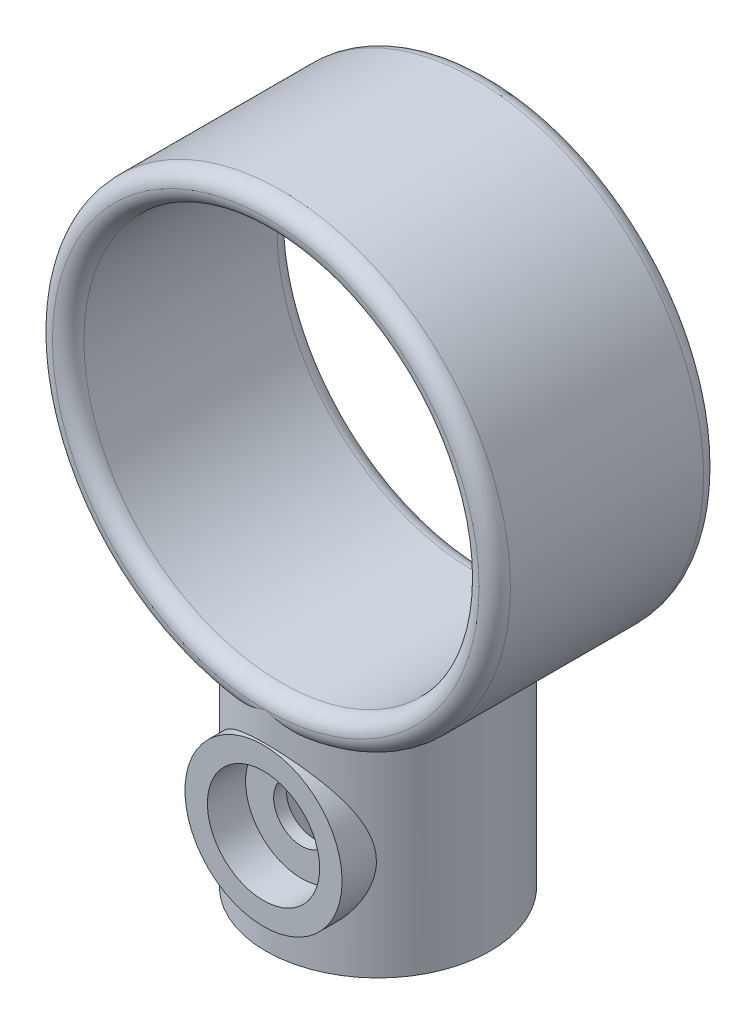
ISO-10303-21;
HEADER;
FILE_DESCRIPTION(('STEP AP214'),'2;1');
FILE_NAME('part.step','',(''),(''),'','','');
FILE_SCHEMA(('AUTOMOTIVE_DESIGN { 1 0 10303 214 1 1 1 1 }'));
ENDSEC;
DATA;
#1=APPLICATION_CONTEXT('core data for automotive mechanical design processes');
#2=APPLICATION_PROTOCOL_DEFINITION('international standard','automotive_design',2000,#1);
#3=PRODUCT_CONTEXT('',#1,'mechanical');
#4=PRODUCT('Part','Part','',(#3));
#5=PRODUCT_RELATED_PRODUCT_CATEGORY('part','',(#4));
#6=PRODUCT_DEFINITION_FORMATION('','',#4);
#7=PRODUCT_DEFINITION_CONTEXT('part definition',#1,'design');
#8=PRODUCT_DEFINITION('design','',#6,#7);
#9=PRODUCT_DEFINITION_SHAPE('','',#8);
#10=(LENGTH_UNIT() NAMED_UNIT(*) SI_UNIT(.MILLI.,.METRE.));
#11=(NAMED_UNIT(*) PLANE_ANGLE_UNIT() SI_UNIT($,.RADIAN.));
#12=(NAMED_UNIT(*) SI_UNIT($,.STERADIAN.) SOLID_ANGLE_UNIT());
#13=UNCERTAINTY_MEASURE_WITH_UNIT(LENGTH_MEASURE(1.E-05),#10,'distance_accuracy_value','');
#14=(GEOMETRIC_REPRESENTATION_CONTEXT(3) GLOBAL_UNCERTAINTY_ASSIGNED_CONTEXT((#13)) GLOBAL_UNIT_ASSIGNED_CONTEXT((#10,
#11,#12)) REPRESENTATION_CONTEXT('',''));
#15=CARTESIAN_POINT('',(0.,0.,0.));
#16=DIRECTION('',(0.,0.,1.));
#17=DIRECTION('',(1.,0.,0.));
#18=AXIS2_PLACEMENT_3D('',#15,#16,#17);
#19=CARTESIAN_POINT('',(-1.58750000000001,-13.081,3.60275071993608));
#20=DIRECTION('',(0.,0.,-1.));
#21=DIRECTION('',(-1.,0.,0.));
#22=AXIS2_PLACEMENT_3D('',#19,#20,#21);
#23=PLANE('',#22);
#24=CARTESIAN_POINT('',(0.,-18.161,3.60275071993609));
#25=DIRECTION('',(0.,0.,-1.));
#26=DIRECTION('',(-1.,0.,0.));
#27=AXIS2_PLACEMENT_3D('',#24,#25,#26);
#28=CIRCLE('',#27,1.5875);
#29=CARTESIAN_POINT('',(1.58750000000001,-18.161,3.60275071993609));
#30=VERTEX_POINT('',#29);
#31=CARTESIAN_POINT('',(-1.58750000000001,-18.161,3.60275071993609));
#32=VERTEX_POINT('',#31);
#33=EDGE_CURVE('E49',#30,#32,#28,.F.);
#34=ORIENTED_EDGE('',*,*,#33,.T.);
#35=DIRECTION('',(0.,-1.,0.));
#36=VECTOR('',#35,1.);
#37=CARTESIAN_POINT('',(-1.58750000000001,-13.081,3.60275071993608));
#38=LINE('',#37,#36);
#39=CARTESIAN_POINT('',(-1.58750000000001,-13.081,3.60275071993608));
#40=VERTEX_POINT('',#39);
#41=EDGE_CURVE('E95',#40,#32,#38,.T.);
#42=ORIENTED_EDGE('',*,*,#41,.F.);
#43=DIRECTION('',(1.,0.,0.));
#44=VECTOR('',#43,1.);
#45=CARTESIAN_POINT('',(-1.58750000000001,-13.081,3.60275071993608));
#46=LINE('',#45,#44);
#47=CARTESIAN_POINT('',(1.58750000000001,-13.081,3.60275071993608));
#48=VERTEX_POINT('',#47);
#49=EDGE_CURVE('E301',#40,#48,#46,.T.);
#50=ORIENTED_EDGE('',*,*,#49,.T.);
#51=DIRECTION('',(0.,-1.,0.));
#52=VECTOR('',#51,1.);
#53=CARTESIAN_POINT('',(1.58750000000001,-13.081,3.60275071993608));
#54=LINE('',#53,#52);
#55=EDGE_CURVE('E98',#48,#30,#54,.T.);
#56=ORIENTED_EDGE('',*,*,#55,.T.);
#57=EDGE_LOOP('',(#34,#42,#50,#56));
#58=FACE_BOUND('',#57,.T.);
#59=ADVANCED_FACE('F33',(#58),#23,.T.);
#60=CARTESIAN_POINT('',(0.,0.,6.35));
#61=DIRECTION('',(0.,0.,-1.));
#62=DIRECTION('',(-1.,0.,0.));
#63=AXIS2_PLACEMENT_3D('',#60,#61,#62);
#64=CYLINDRICAL_SURFACE('',#63,12.954);
#65=CARTESIAN_POINT('',(3.24036710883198,-12.5421743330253,5.46099999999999));
#66=CARTESIAN_POINT('',(3.39852522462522,-12.5013289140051,5.3671597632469));
#67=CARTESIAN_POINT('',(3.55217752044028,-12.4584249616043,5.26669390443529));
#68=CARTESIAN_POINT('',(3.8496509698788,-12.3697324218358,5.05333201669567));
#69=CARTESIAN_POINT('',(3.99347466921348,-12.3239445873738,4.94043922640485));
#70=CARTESIAN_POINT('',(4.27083010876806,-12.2306014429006,4.70275872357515));
#71=CARTESIAN_POINT('',(4.40434080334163,-12.1830427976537,4.57794779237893));
#72=CARTESIAN_POINT('',(4.66006458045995,-12.0875364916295,4.31736305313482));
#73=CARTESIAN_POINT('',(4.78227686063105,-12.0395888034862,4.18158846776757));
#74=CARTESIAN_POINT('',(5.0146904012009,-11.944653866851,3.89983668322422));
#75=CARTESIAN_POINT('',(5.12489323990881,-11.8976664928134,3.75386082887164));
#76=CARTESIAN_POINT('',(5.33259764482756,-11.8060325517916,3.45244782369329));
#77=CARTESIAN_POINT('',(5.43009998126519,-11.7613858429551,3.29701124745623));
#78=CARTESIAN_POINT('',(5.61163527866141,-11.6758611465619,2.97754710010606));
#79=CARTESIAN_POINT('',(5.69567354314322,-11.634981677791,2.8135229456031));
#80=CARTESIAN_POINT('',(5.84950609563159,-11.5584072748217,2.47786884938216));
#81=CARTESIAN_POINT('',(5.91930894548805,-11.5227092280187,2.30624355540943));
#82=CARTESIAN_POINT('',(6.04225375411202,-11.4587068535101,1.96119636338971));
#83=CARTESIAN_POINT('',(6.09579731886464,-11.4302277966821,1.78795037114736));
#84=CARTESIAN_POINT('',(6.18802378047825,-11.3805635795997,1.43660218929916));
#85=CARTESIAN_POINT('',(6.22671417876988,-11.3593747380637,1.2585024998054));
#86=CARTESIAN_POINT('',(6.28868651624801,-11.3251840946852,0.898983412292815));
#87=CARTESIAN_POINT('',(6.31197893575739,-11.3121767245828,0.717566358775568));
#88=CARTESIAN_POINT('',(6.3428187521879,-11.2949141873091,0.352992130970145));
#89=CARTESIAN_POINT('',(6.3503680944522,-11.2906579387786,0.169835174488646));
#90=CARTESIAN_POINT('',(6.34965030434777,-11.2910603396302,-0.174261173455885));
#91=CARTESIAN_POINT('',(6.34318530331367,-11.2947032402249,-0.335209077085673));
#92=CARTESIAN_POINT('',(6.31808188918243,-11.3087650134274,-0.655908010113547));
#93=CARTESIAN_POINT('',(6.29943960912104,-11.3191860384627,-0.815658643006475));
#94=CARTESIAN_POINT('',(6.25021818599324,-11.3464388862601,-1.1326968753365));
#95=CARTESIAN_POINT('',(6.21964262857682,-11.3632687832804,-1.28998519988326));
#96=CARTESIAN_POINT('',(6.14689582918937,-11.4027846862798,-1.60116103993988));
#97=CARTESIAN_POINT('',(6.10472002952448,-11.4254729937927,-1.75504719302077));
#98=CARTESIAN_POINT('',(6.00975901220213,-11.4757030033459,-2.05669794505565));
#99=CARTESIAN_POINT('',(5.95710152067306,-11.5031858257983,-2.20451262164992));
#100=CARTESIAN_POINT('',(5.84134309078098,-11.5623982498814,-2.49513680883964));
#101=CARTESIAN_POINT('',(5.77823846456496,-11.5941293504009,-2.63794453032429));
#102=CARTESIAN_POINT('',(5.57389486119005,-11.694479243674,-3.05794933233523));
#103=CARTESIAN_POINT('',(5.41761476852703,-11.7682609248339,-3.32676388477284));
#104=CARTESIAN_POINT('',(5.04847190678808,-11.9316543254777,-3.86714840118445));
#105=CARTESIAN_POINT('',(4.83113561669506,-12.0221086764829,-4.1353828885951));
#106=CARTESIAN_POINT('',(4.35599693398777,-12.2022811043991,-4.63311734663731));
#107=CARTESIAN_POINT('',(4.09825242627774,-12.2920000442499,-4.86267176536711));
#108=CARTESIAN_POINT('',(3.72972717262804,-12.405838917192,-5.14055569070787));
#109=CARTESIAN_POINT('',(3.6344671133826,-12.4341060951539,-5.20834633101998));
#110=CARTESIAN_POINT('',(3.44020812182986,-12.4892450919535,-5.33864235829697));
#111=CARTESIAN_POINT('',(3.34121442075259,-12.5161187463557,-5.40115476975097));
#112=CARTESIAN_POINT('',(3.24036710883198,-12.5421743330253,-5.46100000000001));
#113=B_SPLINE_CURVE_WITH_KNOTS('',3,(#65,#66,#67,#68,#69,#70,#71,#72,#73,#74,#75,#76,#77,#78,
#79,#80,#81,#82,#83,#84,#85,#86,#87,#88,#89,#90,#91,#92,#93,#94,#95,#96,#97,#98,#99,#100,#101,
#102,#103,#104,#105,#106,#107,#108,#109,#110,#111,#112),.UNSPECIFIED.,.F.,.F.,(4,2,2,2,2,2,2,2,
2,2,2,2,2,2,2,2,2,2,2,2,2,2,2,4),(0.,0.56491857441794,1.1296902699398,1.69558560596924,
2.26152109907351,2.82738212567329,3.3932088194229,3.95881208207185,4.52407415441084,
5.07395790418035,5.62356357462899,6.17279478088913,6.72195811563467,7.20471712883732,
7.68762951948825,8.17039691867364,8.65335426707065,9.13075176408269,9.6083181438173,
10.5633377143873,11.6297455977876,12.6946395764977,13.0553653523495,13.4156032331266),.UNSPECIFIED.);
#114=CARTESIAN_POINT('',(3.24036710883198,-12.5421743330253,5.46099999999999));
#115=VERTEX_POINT('',#114);
#116=CARTESIAN_POINT('',(3.24036710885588,-12.5421743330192,-5.46100000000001));
#117=VERTEX_POINT('',#116);
#118=EDGE_CURVE('E186',#115,#117,#113,.T.);
#119=ORIENTED_EDGE('',*,*,#118,.T.);
#120=CARTESIAN_POINT('',(0.,0.,-5.461));
#121=DIRECTION('',(0.,0.,1.));
#122=DIRECTION('',(1.,0.,0.));
#123=AXIS2_PLACEMENT_3D('',#120,#121,#122);
#124=CIRCLE('',#123,12.954);
#125=CARTESIAN_POINT('',(-3.24036710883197,-12.5421743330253,-5.461));
#126=VERTEX_POINT('',#125);
#127=EDGE_CURVE('E206',#117,#126,#124,.T.);
#128=ORIENTED_EDGE('',*,*,#127,.T.);
#129=CARTESIAN_POINT('',(-3.24036710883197,-12.5421743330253,-5.461));
#130=CARTESIAN_POINT('',(-3.39852522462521,-12.5013289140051,-5.3671597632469));
#131=CARTESIAN_POINT('',(-3.55217752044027,-12.4584249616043,-5.26669390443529));
#132=CARTESIAN_POINT('',(-3.84965096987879,-12.3697324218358,-5.05333201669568));
#133=CARTESIAN_POINT('',(-3.99347466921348,-12.3239445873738,-4.94043922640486));
#134=CARTESIAN_POINT('',(-4.27083010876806,-12.2306014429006,-4.70275872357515));
#135=CARTESIAN_POINT('',(-4.40434080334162,-12.1830427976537,-4.57794779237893));
#136=CARTESIAN_POINT('',(-4.66006458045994,-12.0875364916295,-4.31736305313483));
#137=CARTESIAN_POINT('',(-4.78227686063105,-12.0395888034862,-4.18158846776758));
#138=CARTESIAN_POINT('',(-5.0146904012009,-11.944653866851,-3.89983668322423));
#139=CARTESIAN_POINT('',(-5.12489323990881,-11.8976664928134,-3.75386082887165));
#140=CARTESIAN_POINT('',(-5.33259764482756,-11.8060325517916,-3.4524478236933));
#141=CARTESIAN_POINT('',(-5.43009998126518,-11.7613858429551,-3.29701124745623));
#142=CARTESIAN_POINT('',(-5.61163527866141,-11.6758611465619,-2.97754710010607));
#143=CARTESIAN_POINT('',(-5.69567354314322,-11.634981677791,-2.81352294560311));
#144=CARTESIAN_POINT('',(-5.84950609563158,-11.5584072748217,-2.47786884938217));
#145=CARTESIAN_POINT('',(-5.91930894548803,-11.5227092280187,-2.30624355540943));
#146=CARTESIAN_POINT('',(-6.042253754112,-11.4587068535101,-1.96119636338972));
#147=CARTESIAN_POINT('',(-6.09579731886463,-11.4302277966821,-1.78795037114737));
#148=CARTESIAN_POINT('',(-6.18802378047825,-11.3805635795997,-1.43660218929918));
#149=CARTESIAN_POINT('',(-6.22671417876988,-11.3593747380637,-1.25850249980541));
#150=CARTESIAN_POINT('',(-6.28868651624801,-11.3251840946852,-0.898983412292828));
#151=CARTESIAN_POINT('',(-6.31197893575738,-11.3121767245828,-0.717566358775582));
#152=CARTESIAN_POINT('',(-6.3428187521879,-11.2949141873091,-0.35299213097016));
#153=CARTESIAN_POINT('',(-6.3503680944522,-11.2906579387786,-0.16983517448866));
#154=CARTESIAN_POINT('',(-6.34965030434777,-11.2910603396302,0.174261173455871));
#155=CARTESIAN_POINT('',(-6.34318530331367,-11.2947032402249,0.33520907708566));
#156=CARTESIAN_POINT('',(-6.31808188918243,-11.3087650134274,0.655908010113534));
#157=CARTESIAN_POINT('',(-6.29943960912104,-11.3191860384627,0.815658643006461));
#158=CARTESIAN_POINT('',(-6.25021818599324,-11.3464388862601,1.13269687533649));
#159=CARTESIAN_POINT('',(-6.21964262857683,-11.3632687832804,1.28998519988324));
#160=CARTESIAN_POINT('',(-6.14689582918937,-11.4027846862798,1.60116103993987));
#161=CARTESIAN_POINT('',(-6.10472002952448,-11.4254729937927,1.75504719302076));
#162=CARTESIAN_POINT('',(-6.00975901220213,-11.4757030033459,2.05669794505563));
#163=CARTESIAN_POINT('',(-5.95710152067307,-11.5031858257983,2.20451262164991));
#164=CARTESIAN_POINT('',(-5.84134309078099,-11.5623982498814,2.49513680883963));
#165=CARTESIAN_POINT('',(-5.77823846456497,-11.5941293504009,2.63794453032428));
#166=CARTESIAN_POINT('',(-5.57389486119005,-11.694479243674,3.05794933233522));
#167=CARTESIAN_POINT('',(-5.41761476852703,-11.7682609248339,3.32676388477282));
#168=CARTESIAN_POINT('',(-5.04847190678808,-11.9316543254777,3.86714840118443));
#169=CARTESIAN_POINT('',(-4.83113561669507,-12.0221086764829,4.13538288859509));
#170=CARTESIAN_POINT('',(-4.35599693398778,-12.2022811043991,4.63311734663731));
#171=CARTESIAN_POINT('',(-4.09825242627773,-12.2920000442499,4.8626717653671));
#172=CARTESIAN_POINT('',(-3.72972717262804,-12.405838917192,5.14055569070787));
#173=CARTESIAN_POINT('',(-3.6344671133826,-12.4341060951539,5.20834633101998));
#174=CARTESIAN_POINT('',(-3.44020812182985,-12.4892450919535,5.33864235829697));
#175=CARTESIAN_POINT('',(-3.34121442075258,-12.5161187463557,5.40115476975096));
#176=CARTESIAN_POINT('',(-3.24036710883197,-12.5421743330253,5.46099999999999));
#177=B_SPLINE_CURVE_WITH_KNOTS('',3,(#129,#130,#131,#132,#133,#134,#135,#136,#137,#138,#139,
#140,#141,#142,#143,#144,#145,#146,#147,#148,#149,#150,#151,#152,#153,#154,#155,#156,#157,#158,
#159,#160,#161,#162,#163,#164,#165,#166,#167,#168,#169,#170,#171,#172,#173,#174,#175,#176),
.UNSPECIFIED.,.F.,.F.,(4,2,2,2,2,2,2,2,2,2,2,2,2,2,2,2,2,2,2,2,2,2,2,4),(0.,0.564918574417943,
1.12969026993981,1.69558560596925,2.26152109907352,2.8273821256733,3.39320881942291,
3.95881208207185,4.52407415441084,5.07395790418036,5.62356357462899,6.17279478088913,
6.72195811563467,7.20471712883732,7.68762951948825,8.17039691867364,8.65335426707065,
9.1307517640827,9.6083181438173,10.5633377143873,11.6297455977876,12.6946395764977,
13.0553653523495,13.4156032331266),.UNSPECIFIED.);
#178=CARTESIAN_POINT('',(-3.24036710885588,-12.5421743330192,5.46099999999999));
#179=VERTEX_POINT('',#178);
#180=EDGE_CURVE('E181',#126,#179,#177,.T.);
#181=ORIENTED_EDGE('',*,*,#180,.T.);
#182=CARTESIAN_POINT('',(0.,0.,5.461));
#183=DIRECTION('',(0.,0.,1.));
#184=DIRECTION('',(1.,0.,0.));
#185=AXIS2_PLACEMENT_3D('',#182,#183,#184);
#186=CIRCLE('',#185,12.954);
#187=EDGE_CURVE('E208',#179,#115,#186,.F.);
#188=ORIENTED_EDGE('',*,*,#187,.T.);
#189=EDGE_LOOP('',(#119,#128,#181,#188));
#190=FACE_BOUND('',#189,.T.);
#191=ADVANCED_FACE('F141',(#190),#64,.T.);
#192=CARTESIAN_POINT('',(0.,0.,5.461));
#193=DIRECTION('',(0.,0.,1.));
#194=DIRECTION('',(1.,0.,0.));
#195=AXIS2_PLACEMENT_3D('',#192,#193,#194);
#196=TOROIDAL_SURFACE('',#195,12.065,0.889);
#197=ORIENTED_EDGE('',*,*,#187,.F.);
#198=CARTESIAN_POINT('',(0.,-12.065,6.34999999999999));
#199=CARTESIAN_POINT('',(-0.00497535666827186,-12.0668615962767,6.35000001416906));
#200=CARTESIAN_POINT('',(-0.00995194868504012,-12.0687205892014,6.34999416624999));
#201=CARTESIAN_POINT('',(-0.29672836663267,-12.1756671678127,6.34931912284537));
#202=CARTESIAN_POINT('',(-0.582434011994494,-12.2723149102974,6.32984568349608));
#203=CARTESIAN_POINT('',(-1.01283058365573,-12.3963076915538,6.27038770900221));
#204=CARTESIAN_POINT('',(-1.15680061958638,-12.4341795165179,6.24547220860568));
#205=CARTESIAN_POINT('',(-1.44453512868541,-12.501251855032,6.185257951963));
#206=CARTESIAN_POINT('',(-1.58829967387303,-12.5304577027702,6.14996560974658));
#207=CARTESIAN_POINT('',(-1.92510179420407,-12.5867279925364,6.05448732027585));
#208=CARTESIAN_POINT('',(-2.11771865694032,-12.6094410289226,5.98991176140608));
#209=CARTESIAN_POINT('',(-2.40170474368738,-12.6245893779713,5.8791706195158));
#210=CARTESIAN_POINT('',(-2.49539153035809,-12.6264977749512,5.84002066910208));
#211=CARTESIAN_POINT('',(-2.68065923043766,-12.6231756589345,5.75732810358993));
#212=CARTESIAN_POINT('',(-2.77224144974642,-12.6179497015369,5.71378830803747));
#213=CARTESIAN_POINT('',(-2.92708562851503,-12.6020217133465,5.63559423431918));
#214=CARTESIAN_POINT('',(-2.99103977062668,-12.5932835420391,5.60190418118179));
#215=CARTESIAN_POINT('',(-3.11725228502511,-12.5712265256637,5.5326711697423));
#216=CARTESIAN_POINT('',(-3.17950796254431,-12.5579008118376,5.49712550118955));
#217=CARTESIAN_POINT('',(-3.24070414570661,-12.5420872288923,5.46079999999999));
#218=B_SPLINE_CURVE_WITH_KNOTS('',3,(#198,#199,#200,#201,#202,#203,#204,#205,#206,#207,#208,
#209,#210,#211,#212,#213,#214,#215,#216,#217),.UNSPECIFIED.,.F.,.F.,(4,2,2,2,2,2,2,2,2,4),(0.,
0.015937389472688,0.918168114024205,1.37052248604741,1.82259783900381,2.43338323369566,
2.73776310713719,3.04194871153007,3.2602089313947,3.47879737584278),.UNSPECIFIED.);
#219=CARTESIAN_POINT('',(0.,-12.065,6.34999999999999));
#220=VERTEX_POINT('',#219);
#221=EDGE_CURVE('E112',#220,#179,#218,.T.);
#222=ORIENTED_EDGE('',*,*,#221,.F.);
#223=CARTESIAN_POINT('',(0.,0.,6.35));
#224=DIRECTION('',(0.,0.,1.));
#225=DIRECTION('',(1.,0.,0.));
#226=AXIS2_PLACEMENT_3D('',#223,#224,#225);
#227=CIRCLE('',#226,12.065);
#228=EDGE_CURVE('E209',#220,#220,#227,.F.);
#229=ORIENTED_EDGE('',*,*,#228,.T.);
#230=CARTESIAN_POINT('',(3.24070414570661,-12.5420872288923,5.46079999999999));
#231=CARTESIAN_POINT('',(3.1774310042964,-12.5584361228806,5.49835688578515));
#232=CARTESIAN_POINT('',(3.11303726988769,-12.5721249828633,5.53507566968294));
#233=CARTESIAN_POINT('',(2.98241388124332,-12.5946122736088,5.60653441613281));
#234=CARTESIAN_POINT('',(2.91618629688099,-12.6034159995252,5.64127648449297));
#235=CARTESIAN_POINT('',(2.71584054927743,-12.6231183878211,5.74185754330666));
#236=CARTESIAN_POINT('',(2.57940037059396,-12.6274673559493,5.80444370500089));
#237=CARTESIAN_POINT('',(2.32981479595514,-12.6222217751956,5.90838835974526));
#238=CARTESIAN_POINT('',(2.21731158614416,-12.6151794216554,5.95150677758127));
#239=CARTESIAN_POINT('',(1.99072682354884,-12.5930454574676,6.03108112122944));
#240=CARTESIAN_POINT('',(1.87664458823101,-12.5779502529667,6.06753406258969));
#241=CARTESIAN_POINT('',(1.53260221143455,-12.5222786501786,6.16689493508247));
#242=CARTESIAN_POINT('',(1.30126722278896,-12.4713340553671,6.21963097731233));
#243=CARTESIAN_POINT('',(0.945543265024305,-12.3775482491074,6.28049610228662));
#244=CARTESIAN_POINT('',(0.820672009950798,-12.3416721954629,6.29799398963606));
#245=CARTESIAN_POINT('',(0.571772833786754,-12.2651057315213,6.32544046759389));
#246=CARTESIAN_POINT('',(0.447743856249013,-12.2244234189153,6.33540155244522));
#247=CARTESIAN_POINT('',(0.220741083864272,-12.146010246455,6.34700860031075));
#248=CARTESIAN_POINT('',(0.11761462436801,-12.1088706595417,6.34974105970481));
#249=CARTESIAN_POINT('',(0.00995213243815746,-12.068720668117,6.34999415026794));
#250=CARTESIAN_POINT('',(0.00497554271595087,-12.0668616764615,6.34999999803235));
#251=CARTESIAN_POINT('',(0.,-12.065,6.34999999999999));
#252=B_SPLINE_CURVE_WITH_KNOTS('',3,(#230,#231,#232,#233,#234,#235,#236,#237,#238,#239,#240,
#241,#242,#243,#244,#245,#246,#247,#248,#249,#250,#251),.UNSPECIFIED.,.F.,.F.,(4,2,2,2,2,2,2,2,
2,2,4),(0.,0.225974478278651,0.451703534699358,0.900832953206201,1.26243424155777,
1.62419704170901,2.34907332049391,2.74214119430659,3.1345560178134,3.4633328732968,
3.47927026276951),.UNSPECIFIED.);
#253=EDGE_CURVE('E111',#115,#220,#252,.T.);
#254=ORIENTED_EDGE('',*,*,#253,.F.);
#255=EDGE_LOOP('',(#197,#222,#229,#254));
#256=FACE_BOUND('',#255,.T.);
#257=ADVANCED_FACE('F144',(#256),#196,.T.);
#258=CARTESIAN_POINT('',(0.,0.,-5.461));
#259=DIRECTION('',(0.,0.,1.));
#260=DIRECTION('',(1.,0.,0.));
#261=AXIS2_PLACEMENT_3D('',#258,#259,#260);
#262=TOROIDAL_SURFACE('',#261,12.065,0.889);
#263=ORIENTED_EDGE('',*,*,#127,.F.);
#264=CARTESIAN_POINT('',(0.,-12.065,-6.35));
#265=CARTESIAN_POINT('',(0.00497535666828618,-12.0668615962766,-6.35000001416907));
#266=CARTESIAN_POINT('',(0.00995194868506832,-12.0687205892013,-6.34999416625));
#267=CARTESIAN_POINT('',(0.296728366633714,-12.1756671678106,-6.34931912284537));
#268=CARTESIAN_POINT('',(0.582434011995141,-12.2723149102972,-6.32984568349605));
#269=CARTESIAN_POINT('',(1.01283058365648,-12.3963076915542,-6.27038770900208));
#270=CARTESIAN_POINT('',(1.15680061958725,-12.4341795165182,-6.24547220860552));
#271=CARTESIAN_POINT('',(1.44453512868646,-12.5012518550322,-6.18525795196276));
#272=CARTESIAN_POINT('',(1.58829967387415,-12.5304577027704,-6.1499656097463));
#273=CARTESIAN_POINT('',(1.92510179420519,-12.5867279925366,-6.05448732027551));
#274=CARTESIAN_POINT('',(2.11771865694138,-12.6094410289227,-5.98991176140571));
#275=CARTESIAN_POINT('',(2.40170474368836,-12.6245893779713,-5.87917061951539));
#276=CARTESIAN_POINT('',(2.49539153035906,-12.6264977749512,-5.84002066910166));
#277=CARTESIAN_POINT('',(2.68065923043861,-12.6231756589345,-5.7573281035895));
#278=CARTESIAN_POINT('',(2.77224144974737,-12.6179497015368,-5.71378830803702));
#279=CARTESIAN_POINT('',(2.9270856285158,-12.6020217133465,-5.63559423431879));
#280=CARTESIAN_POINT('',(2.9910397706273,-12.5932835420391,-5.60190418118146));
#281=CARTESIAN_POINT('',(3.11725228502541,-12.5712265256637,-5.53267116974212));
#282=CARTESIAN_POINT('',(3.17950796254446,-12.5579008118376,-5.49712550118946));
#283=CARTESIAN_POINT('',(3.24070414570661,-12.5420872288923,-5.46080000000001));
#284=B_SPLINE_CURVE_WITH_KNOTS('',3,(#264,#265,#266,#267,#268,#269,#270,#271,#272,#273,#274,
#275,#276,#277,#278,#279,#280,#281,#282,#283),.UNSPECIFIED.,.F.,.F.,(4,2,2,2,2,2,2,2,2,4),(0.,
0.0159373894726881,0.918168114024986,1.37052248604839,1.82259783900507,2.43338323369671,
2.73776310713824,3.04194871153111,3.26020893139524,3.47879737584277),.UNSPECIFIED.);
#285=CARTESIAN_POINT('',(0.,-12.065,-6.35));
#286=VERTEX_POINT('',#285);
#287=EDGE_CURVE('E196',#286,#117,#284,.T.);
#288=ORIENTED_EDGE('',*,*,#287,.F.);
#289=CARTESIAN_POINT('',(0.,0.,-6.35));
#290=DIRECTION('',(0.,0.,1.));
#291=DIRECTION('',(1.,0.,0.));
#292=AXIS2_PLACEMENT_3D('',#289,#290,#291);
#293=CIRCLE('',#292,12.065);
#294=EDGE_CURVE('E37',#286,#286,#293,.T.);
#295=ORIENTED_EDGE('',*,*,#294,.T.);
#296=CARTESIAN_POINT('',(-3.24070414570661,-12.5420872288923,-5.4608));
#297=CARTESIAN_POINT('',(-3.17741475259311,-12.5584402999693,-5.49836653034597));
#298=CARTESIAN_POINT('',(-3.11300424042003,-12.5721319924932,-5.53509450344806));
#299=CARTESIAN_POINT('',(-2.98234681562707,-12.5946224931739,-5.60657034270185));
#300=CARTESIAN_POINT('',(-2.91610198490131,-12.6034266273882,-5.64132032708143));
#301=CARTESIAN_POINT('',(-2.7157709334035,-12.6231205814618,-5.74188948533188));
#302=CARTESIAN_POINT('',(-2.57936481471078,-12.6274665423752,-5.80445845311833));
#303=CARTESIAN_POINT('',(-2.32985660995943,-12.6222227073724,-5.9083709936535));
#304=CARTESIAN_POINT('',(-2.21739646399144,-12.6151848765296,-5.95147439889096));
#305=CARTESIAN_POINT('',(-1.99089781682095,-12.593064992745,-6.03102364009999));
#306=CARTESIAN_POINT('',(-1.87685866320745,-12.5779795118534,-6.0674666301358));
#307=CARTESIAN_POINT('',(-1.53278612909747,-12.5223192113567,-6.16685301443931));
#308=CARTESIAN_POINT('',(-1.30139335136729,-12.4713657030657,-6.21960760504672));
#309=CARTESIAN_POINT('',(-0.893168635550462,-12.3637410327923,-6.28945889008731));
#310=CARTESIAN_POINT('',(-0.716085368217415,-12.31111230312,-6.31197857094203));
#311=CARTESIAN_POINT('',(-0.363866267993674,-12.196927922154,-6.3420209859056));
#312=CARTESIAN_POINT('',(-0.188727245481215,-12.1353903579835,-6.34957366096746));
#313=CARTESIAN_POINT('',(-0.00995206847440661,-12.0687206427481,-6.34999415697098));
#314=CARTESIAN_POINT('',(-0.00497547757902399,-12.0668616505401,-6.35000000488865));
#315=CARTESIAN_POINT('',(0.,-12.065,-6.35));
#316=B_SPLINE_CURVE_WITH_KNOTS('',3,(#296,#297,#298,#299,#300,#301,#302,#303,#304,#305,#306,
#307,#308,#309,#310,#311,#312,#313,#314,#315),.UNSPECIFIED.,.F.,.F.,(4,2,2,2,2,2,2,2,2,4),(0.,
0.226032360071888,0.451817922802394,0.900833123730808,1.26229961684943,1.62392020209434,
2.3490729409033,2.90664789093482,3.46310630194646,3.47904369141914),.UNSPECIFIED.);
#317=EDGE_CURVE('E200',#126,#286,#316,.T.);
#318=ORIENTED_EDGE('',*,*,#317,.F.);
#319=EDGE_LOOP('',(#263,#288,#295,#318));
#320=FACE_BOUND('',#319,.T.);
#321=ADVANCED_FACE('F139',(#320),#262,.T.);
#322=CARTESIAN_POINT('',(0.,0.,6.35));
#323=DIRECTION('',(0.,0.,-1.));
#324=DIRECTION('',(-1.,0.,0.));
#325=AXIS2_PLACEMENT_3D('',#322,#323,#324);
#326=CYLINDRICAL_SURFACE('',#325,11.176);
#327=CARTESIAN_POINT('',(0.,0.,5.461));
#328=DIRECTION('',(0.,0.,1.));
#329=DIRECTION('',(1.,0.,0.));
#330=AXIS2_PLACEMENT_3D('',#327,#328,#329);
#331=CIRCLE('',#330,11.176);
#332=CARTESIAN_POINT('',(11.176,0.,5.461));
#333=VERTEX_POINT('',#332);
#334=EDGE_CURVE('E11',#333,#333,#331,.T.);
#335=ORIENTED_EDGE('',*,*,#334,.T.);
#336=EDGE_LOOP('',(#335));
#337=FACE_BOUND('',#336,.T.);
#338=CARTESIAN_POINT('',(0.,0.,-5.461));
#339=DIRECTION('',(0.,0.,1.));
#340=DIRECTION('',(1.,0.,0.));
#341=AXIS2_PLACEMENT_3D('',#338,#339,#340);
#342=CIRCLE('',#341,11.176);
#343=CARTESIAN_POINT('',(11.176,0.,-5.461));
#344=VERTEX_POINT('',#343);
#345=EDGE_CURVE('E42',#344,#344,#342,.F.);
#346=ORIENTED_EDGE('',*,*,#345,.T.);
#347=EDGE_LOOP('',(#346));
#348=FACE_BOUND('',#347,.T.);
#349=ADVANCED_FACE('F134',(#337,#348),#326,.F.);
#350=CARTESIAN_POINT('',(0.,0.,5.461));
#351=DIRECTION('',(0.,0.,1.));
#352=DIRECTION('',(1.,0.,0.));
#353=AXIS2_PLACEMENT_3D('',#350,#351,#352);
#354=TOROIDAL_SURFACE('',#353,12.065,0.889);
#355=ORIENTED_EDGE('',*,*,#334,.F.);
#356=EDGE_LOOP('',(#355));
#357=FACE_BOUND('',#356,.T.);
#358=ORIENTED_EDGE('',*,*,#228,.F.);
#359=EDGE_LOOP('',(#358));
#360=FACE_BOUND('',#359,.T.);
#361=ADVANCED_FACE('F138',(#357,#360),#354,.T.);
#362=CARTESIAN_POINT('',(0.,0.,-5.461));
#363=DIRECTION('',(0.,0.,1.));
#364=DIRECTION('',(1.,0.,0.));
#365=AXIS2_PLACEMENT_3D('',#362,#363,#364);
#366=TOROIDAL_SURFACE('',#365,12.065,0.889);
#367=ORIENTED_EDGE('',*,*,#345,.F.);
#368=EDGE_LOOP('',(#367));
#369=FACE_BOUND('',#368,.T.);
#370=ORIENTED_EDGE('',*,*,#294,.F.);
#371=EDGE_LOOP('',(#370));
#372=FACE_BOUND('',#371,.T.);
#373=ADVANCED_FACE('F35',(#369,#372),#366,.T.);
#374=CARTESIAN_POINT('',(0.,-23.876,0.));
#375=DIRECTION('',(0.,1.,0.));
#376=DIRECTION('',(0.,0.,1.));
#377=AXIS2_PLACEMENT_3D('',#374,#375,#376);
#378=PLANE('',#377);
#379=DIRECTION('',(1.,0.,0.));
#380=VECTOR('',#379,1.);
#381=CARTESIAN_POINT('',(-1.58750000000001,-23.876,3.60275071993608));
#382=LINE('',#381,#380);
#383=CARTESIAN_POINT('',(-1.58750000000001,-23.876,3.60275071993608));
#384=VERTEX_POINT('',#383);
#385=CARTESIAN_POINT('',(1.58750000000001,-23.876,3.60275071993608));
#386=VERTEX_POINT('',#385);
#387=EDGE_CURVE('E103',#384,#386,#382,.T.);
#388=ORIENTED_EDGE('',*,*,#387,.T.);
#389=CARTESIAN_POINT('',(0.,-23.876,0.));
#390=DIRECTION('',(0.,-1.,0.));
#391=DIRECTION('',(0.,0.,-1.));
#392=AXIS2_PLACEMENT_3D('',#389,#390,#391);
#393=CIRCLE('',#392,3.937);
#394=EDGE_CURVE('E296',#384,#386,#393,.T.);
#395=ORIENTED_EDGE('',*,*,#394,.F.);
#396=EDGE_LOOP('',(#388,#395));
#397=FACE_BOUND('',#396,.T.);
#398=CARTESIAN_POINT('',(0.,-23.876,0.));
#399=DIRECTION('',(0.,1.,0.));
#400=DIRECTION('',(0.,0.,1.));
#401=AXIS2_PLACEMENT_3D('',#398,#399,#400);
#402=CIRCLE('',#401,6.35);
#403=CARTESIAN_POINT('',(0.,-23.876,6.35));
#404=VERTEX_POINT('',#403);
#405=EDGE_CURVE('E191',#404,#404,#402,.T.);
#406=ORIENTED_EDGE('',*,*,#405,.F.);
#407=EDGE_LOOP('',(#406));
#408=FACE_BOUND('',#407,.T.);
#409=ADVANCED_FACE('F173',(#397,#408),#378,.F.);
#410=CARTESIAN_POINT('',(0.,12.955,0.));
#411=DIRECTION('',(0.,-1.,0.));
#412=DIRECTION('',(0.,0.,-1.));
#413=AXIS2_PLACEMENT_3D('',#410,#411,#412);
#414=CYLINDRICAL_SURFACE('',#413,6.35);
#415=CARTESIAN_POINT('',(4.44500000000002,-18.161,4.53480705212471));
#416=CARTESIAN_POINT('',(4.44499937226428,-18.0543062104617,4.53480817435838));
#417=CARTESIAN_POINT('',(4.44114970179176,-17.947604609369,4.5385908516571));
#418=CARTESIAN_POINT('',(4.42584625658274,-17.7352688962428,4.55351466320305));
#419=CARTESIAN_POINT('',(4.41439151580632,-17.6296349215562,4.56465673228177));
#420=CARTESIAN_POINT('',(4.38411489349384,-17.4202074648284,4.59374296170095));
#421=CARTESIAN_POINT('',(4.36528078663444,-17.3164173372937,4.61169840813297));
#422=CARTESIAN_POINT('',(4.32061506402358,-17.111562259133,4.6535707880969));
#423=CARTESIAN_POINT('',(4.29477965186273,-17.0104988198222,4.67749095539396));
#424=CARTESIAN_POINT('',(4.20805864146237,-16.7145755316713,4.75612989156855));
#425=CARTESIAN_POINT('',(4.13756586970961,-16.5243845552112,4.81813098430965));
#426=CARTESIAN_POINT('',(3.97374457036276,-16.1591071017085,4.95410739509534));
#427=CARTESIAN_POINT('',(3.88041445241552,-15.9840216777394,5.0280835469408));
#428=CARTESIAN_POINT('',(3.6545041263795,-15.6201107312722,5.1951985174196));
#429=CARTESIAN_POINT('',(3.51791257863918,-15.4342485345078,5.28942445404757));
#430=CARTESIAN_POINT('',(3.29274248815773,-15.1728362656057,5.43030880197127));
#431=CARTESIAN_POINT('',(3.21422605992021,-15.0885281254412,5.47723622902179));
#432=CARTESIAN_POINT('',(3.05053180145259,-14.9259439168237,5.57006248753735));
#433=CARTESIAN_POINT('',(2.96535249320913,-14.847669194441,5.6159610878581));
#434=CARTESIAN_POINT('',(2.77375715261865,-14.6849938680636,5.7133325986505));
#435=CARTESIAN_POINT('',(2.66617104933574,-14.6017557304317,5.76445514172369));
#436=CARTESIAN_POINT('',(2.44262247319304,-14.4447835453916,5.86267815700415));
#437=CARTESIAN_POINT('',(2.32666380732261,-14.3710452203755,5.90978043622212));
#438=CARTESIAN_POINT('',(2.0869883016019,-14.2339751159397,5.99860631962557));
#439=CARTESIAN_POINT('',(1.96328183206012,-14.1706298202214,6.0403368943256));
#440=CARTESIAN_POINT('',(1.70883584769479,-14.05521975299,6.11719376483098));
#441=CARTESIAN_POINT('',(1.578099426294,-14.0031500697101,6.1523229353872));
#442=CARTESIAN_POINT('',(1.24886776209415,-13.8900579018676,6.22920254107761));
#443=CARTESIAN_POINT('',(1.04687520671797,-13.8359409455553,6.26656155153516));
#444=CARTESIAN_POINT('',(0.634826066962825,-13.7565699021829,6.32160276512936));
#445=CARTESIAN_POINT('',(0.424776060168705,-13.731292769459,6.33930067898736));
#446=CARTESIAN_POINT('',(0.00205416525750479,-13.7109597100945,6.35352469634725));
#447=CARTESIAN_POINT('',(-0.21062201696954,-13.7159624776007,6.35000968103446));
#448=CARTESIAN_POINT('',(-0.63172111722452,-13.7560342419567,6.32202480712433));
#449=CARTESIAN_POINT('',(-0.840142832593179,-13.7911116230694,6.29754910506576));
#450=CARTESIAN_POINT('',(-1.24229246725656,-13.8882276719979,6.23055861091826));
#451=CARTESIAN_POINT('',(-1.43624715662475,-13.9496328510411,6.18846819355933));
#452=CARTESIAN_POINT('',(-1.81067974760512,-14.0965248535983,6.08945775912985));
#453=CARTESIAN_POINT('',(-1.99115499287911,-14.1820164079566,6.0325348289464));
#454=CARTESIAN_POINT('',(-2.35550833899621,-14.3850424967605,5.90048404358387));
#455=CARTESIAN_POINT('',(-2.53749482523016,-14.5050965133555,5.82402997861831));
#456=CARTESIAN_POINT('',(-2.87985061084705,-14.7681824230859,5.66258695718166));
#457=CARTESIAN_POINT('',(-3.04019628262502,-14.9112390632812,5.57758884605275));
#458=CARTESIAN_POINT('',(-3.36468334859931,-15.2454486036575,5.38910708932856));
#459=CARTESIAN_POINT('',(-3.52438847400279,-15.4406283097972,5.28503307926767));
#460=CARTESIAN_POINT('',(-3.73833974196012,-15.7529392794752,5.13371333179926));
#461=CARTESIAN_POINT('',(-3.80540844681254,-15.860341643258,5.08405510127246));
#462=CARTESIAN_POINT('',(-3.9306445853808,-16.0815232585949,4.98786048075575));
#463=CARTESIAN_POINT('',(-3.98881360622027,-16.1953013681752,4.94132353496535));
#464=CARTESIAN_POINT('',(-4.1244148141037,-16.4918230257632,4.82939292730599));
#465=CARTESIAN_POINT('',(-4.19547942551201,-16.6788675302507,4.76724819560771));
#466=CARTESIAN_POINT('',(-4.28328877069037,-16.968667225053,4.68801648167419));
#467=CARTESIAN_POINT('',(-4.309421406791,-17.0667698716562,4.66394281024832));
#468=CARTESIAN_POINT('',(-4.35508801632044,-17.2656632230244,4.62132920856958));
#469=CARTESIAN_POINT('',(-4.37462524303,-17.3664525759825,4.60278655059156));
#470=CARTESIAN_POINT('',(-4.40692541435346,-17.5711814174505,4.57187247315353));
#471=CARTESIAN_POINT('',(-4.41961400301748,-17.6751430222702,4.55956887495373));
#472=CARTESIAN_POINT('',(-4.43762088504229,-17.8843019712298,4.542045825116));
#473=CARTESIAN_POINT('',(-4.44293944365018,-17.9894992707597,4.5368261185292));
#474=CARTESIAN_POINT('',(-4.44607439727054,-18.200088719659,4.53375450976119));
#475=CARTESIAN_POINT('',(-4.44389302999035,-18.3054808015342,4.53590040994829));
#476=CARTESIAN_POINT('',(-4.43209711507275,-18.5154169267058,4.54742491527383));
#477=CARTESIAN_POINT('',(-4.42248288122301,-18.6199610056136,4.55680321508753));
#478=CARTESIAN_POINT('',(-4.3864761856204,-18.9020129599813,4.59155489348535));
#479=CARTESIAN_POINT('',(-4.35298747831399,-19.077860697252,4.62358296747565));
#480=CARTESIAN_POINT('',(-4.26642994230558,-19.4207751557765,4.70356253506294));
#481=CARTESIAN_POINT('',(-4.21334047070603,-19.5878324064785,4.75153081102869));
#482=CARTESIAN_POINT('',(-4.06024843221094,-19.9878539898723,4.88377603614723));
#483=CARTESIAN_POINT('',(-3.9499274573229,-20.2147933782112,4.97451235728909));
#484=CARTESIAN_POINT('',(-3.75917535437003,-20.5363386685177,5.11835190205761));
#485=CARTESIAN_POINT('',(-3.69126733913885,-20.6405082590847,5.16766164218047));
#486=CARTESIAN_POINT('',(-3.54730037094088,-20.8424255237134,5.26752582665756));
#487=CARTESIAN_POINT('',(-3.47124236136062,-20.9401739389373,5.31808012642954));
#488=CARTESIAN_POINT('',(-3.22822410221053,-21.2269740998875,5.47157669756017));
#489=CARTESIAN_POINT('',(-3.04874163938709,-21.4056701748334,5.57451767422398));
#490=CARTESIAN_POINT('',(-2.65915223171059,-21.7319037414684,5.7705229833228));
#491=CARTESIAN_POINT('',(-2.44909096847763,-21.8794869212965,5.86360169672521));
#492=CARTESIAN_POINT('',(-2.03697587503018,-22.1177390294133,6.01775884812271));
#493=CARTESIAN_POINT('',(-1.83908252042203,-22.213746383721,6.08157679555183));
#494=CARTESIAN_POINT('',(-1.53014216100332,-22.3358047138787,6.16381241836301));
#495=CARTESIAN_POINT('',(-1.42511517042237,-22.3728391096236,6.18898074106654));
#496=CARTESIAN_POINT('',(-1.21160233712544,-22.43914444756,6.23429261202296));
#497=CARTESIAN_POINT('',(-1.10311801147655,-22.4684187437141,6.25443833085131));
#498=CARTESIAN_POINT('',(-0.882708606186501,-22.5189487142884,6.28934471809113));
#499=CARTESIAN_POINT('',(-0.770766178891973,-22.5401528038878,6.30407072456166));
#500=CARTESIAN_POINT('',(-0.545015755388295,-22.5739355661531,6.32758466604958));
#501=CARTESIAN_POINT('',(-0.431208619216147,-22.5865181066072,6.33637526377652));
#502=CARTESIAN_POINT('',(-0.202662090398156,-22.6028551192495,6.34779628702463));
#503=CARTESIAN_POINT('',(-0.0879227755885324,-22.6066103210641,6.35042722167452));
#504=CARTESIAN_POINT('',(0.141469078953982,-22.6052284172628,6.34945989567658));
#505=CARTESIAN_POINT('',(0.25612162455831,-22.6000919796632,6.3458621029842));
#506=CARTESIAN_POINT('',(0.473258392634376,-22.5819434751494,6.33318075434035));
#507=CARTESIAN_POINT('',(0.575844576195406,-22.5697433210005,6.3246629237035));
#508=CARTESIAN_POINT('',(0.779430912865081,-22.5383438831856,6.30281617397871));
#509=CARTESIAN_POINT('',(0.880430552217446,-22.5191423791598,6.28948572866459));
#510=CARTESIAN_POINT('',(1.18000332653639,-22.4513882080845,6.24266016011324));
#511=CARTESIAN_POINT('',(1.3753248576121,-22.3926707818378,6.20231996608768));
#512=CARTESIAN_POINT('',(1.75931162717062,-22.2483562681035,6.10475557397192));
#513=CARTESIAN_POINT('',(1.94750439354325,-22.1618900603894,6.04698969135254));
#514=CARTESIAN_POINT('',(2.30692333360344,-21.9660016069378,5.91920622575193));
#515=CARTESIAN_POINT('',(2.47814621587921,-21.8565749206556,5.84918627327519));
#516=CARTESIAN_POINT('',(2.82728501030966,-21.598832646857,5.68958211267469));
#517=CARTESIAN_POINT('',(3.00206037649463,-21.4471116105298,5.59865076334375));
#518=CARTESIAN_POINT('',(3.32551437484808,-21.119397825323,5.41278864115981));
#519=CARTESIAN_POINT('',(3.47413723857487,-20.9433546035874,5.31784984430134));
#520=CARTESIAN_POINT('',(3.68654238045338,-20.6480089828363,5.17116088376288));
#521=CARTESIAN_POINT('',(3.75970536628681,-20.5360096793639,5.11805089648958));
#522=CARTESIAN_POINT('',(3.89621323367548,-20.3047302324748,5.01491068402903));
#523=CARTESIAN_POINT('',(3.95955534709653,-20.1854480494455,4.96488132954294));
#524=CARTESIAN_POINT('',(4.0756128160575,-19.9402570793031,4.87006008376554));
#525=CARTESIAN_POINT('',(4.12835637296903,-19.8143670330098,4.82525443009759));
#526=CARTESIAN_POINT('',(4.22262742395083,-19.5561030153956,4.74297788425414));
#527=CARTESIAN_POINT('',(4.26415773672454,-19.4237306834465,4.70550514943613));
#528=CARTESIAN_POINT('',(4.32331466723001,-19.1981705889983,4.65107391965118));
#529=CARTESIAN_POINT('',(4.34430437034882,-19.1065011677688,4.63142948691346));
#530=CARTESIAN_POINT('',(4.38054261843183,-18.9211204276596,4.59716981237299));
#531=CARTESIAN_POINT('',(4.39579299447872,-18.8274097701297,4.58255296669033));
#532=CARTESIAN_POINT('',(4.42028819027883,-18.638623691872,4.55893009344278));
#533=CARTESIAN_POINT('',(4.42954074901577,-18.5435501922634,4.54991683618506));
#534=CARTESIAN_POINT('',(4.4418960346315,-18.3526530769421,4.53785568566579));
#535=CARTESIAN_POINT('',(4.44500056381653,-18.2568296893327,4.53480604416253));
#536=CARTESIAN_POINT('',(4.44500000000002,-18.161,4.53480705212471));
#537=B_SPLINE_CURVE_WITH_KNOTS('',3,(#415,#416,#417,#418,#419,#420,#421,#422,#423,#424,#425,
#426,#427,#428,#429,#430,#431,#432,#433,#434,#435,#436,#437,#438,#439,#440,#441,#442,#443,#444,
#445,#446,#447,#448,#449,#450,#451,#452,#453,#454,#455,#456,#457,#458,#459,#460,#461,#462,#463,
#464,#465,#466,#467,#468,#469,#470,#471,#472,#473,#474,#475,#476,#477,#478,#479,#480,#481,#482,
#483,#484,#485,#486,#487,#488,#489,#490,#491,#492,#493,#494,#495,#496,#497,#498,#499,#500,#501,
#502,#503,#504,#505,#506,#507,#508,#509,#510,#511,#512,#513,#514,#515,#516,#517,#518,#519,#520,
#521,#522,#523,#524,#525,#526,#527,#528,#529,#530,#531,#532,#533,#534,#535,#536),.UNSPECIFIED.,
.T.,.F.,(4,2,2,2,2,2,2,2,2,2,2,2,2,2,2,2,2,2,2,2,2,2,2,2,2,2,2,2,2,2,2,2,2,2,2,2,2,2,2,2,2,2,2,
2,2,2,2,2,2,2,2,2,2,2,2,2,2,2,2,2,4),(0.,0.319961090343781,0.639962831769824,0.960496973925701,
1.28120527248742,1.91474985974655,2.54833857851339,3.29288327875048,3.66582285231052,
4.03884539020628,4.47420897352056,4.90937582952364,5.34397217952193,5.77837883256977,
6.41267801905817,7.04646998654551,7.6814908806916,8.31668886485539,8.93739239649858,
9.5582179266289,10.2487241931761,10.939978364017,11.7546838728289,12.1623275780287,
12.5698985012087,13.1957467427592,13.5084512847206,13.8210013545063,14.1368798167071,
14.4527469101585,14.7685197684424,15.0842792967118,15.6273792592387,16.1710528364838,
16.9708384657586,17.3718491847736,17.7728135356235,18.5892956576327,19.4045703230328,
20.0885218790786,20.4306834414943,20.7726968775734,21.1168611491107,21.4608709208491,
21.8048522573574,22.1488077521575,22.459413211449,22.7701172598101,23.3910051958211,
24.0336313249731,24.6763818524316,25.4196456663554,26.164475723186,26.5958226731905,
27.027290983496,27.4575955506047,27.887791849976,28.1757212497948,28.4635587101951,
28.7510240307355,29.0384050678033),.UNSPECIFIED.);
#538=CARTESIAN_POINT('',(4.44500000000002,-18.161,4.53480705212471));
#539=VERTEX_POINT('',#538);
#540=EDGE_CURVE('E290',#539,#539,#537,.T.);
#541=ORIENTED_EDGE('',*,*,#540,.F.);
#542=EDGE_LOOP('',(#541));
#543=FACE_BOUND('',#542,.T.);
#544=ORIENTED_EDGE('',*,*,#118,.F.);
#545=ORIENTED_EDGE('',*,*,#253,.T.);
#546=ORIENTED_EDGE('',*,*,#221,.T.);
#547=ORIENTED_EDGE('',*,*,#180,.F.);
#548=ORIENTED_EDGE('',*,*,#317,.T.);
#549=ORIENTED_EDGE('',*,*,#287,.T.);
#550=EDGE_LOOP('',(#544,#545,#546,#547,#548,#549));
#551=FACE_BOUND('',#550,.T.);
#552=ORIENTED_EDGE('',*,*,#405,.T.);
#553=EDGE_LOOP('',(#552));
#554=FACE_BOUND('',#553,.T.);
#555=ADVANCED_FACE('F127',(#543,#551,#554),#414,.T.);
#556=CARTESIAN_POINT('',(0.,-13.081,0.));
#557=DIRECTION('',(0.,-1.,0.));
#558=DIRECTION('',(0.,0.,-1.));
#559=AXIS2_PLACEMENT_3D('',#556,#557,#558);
#560=CYLINDRICAL_SURFACE('',#559,3.937);
#561=ORIENTED_EDGE('',*,*,#394,.T.);
#562=EDGE_CURVE('E56',#30,#386,#54,.T.);
#563=ORIENTED_EDGE('',*,*,#562,.F.);
#564=ORIENTED_EDGE('',*,*,#55,.F.);
#565=CARTESIAN_POINT('',(0.,-13.081,0.));
#566=DIRECTION('',(0.,-1.,0.));
#567=DIRECTION('',(0.,0.,-1.));
#568=AXIS2_PLACEMENT_3D('',#565,#566,#567);
#569=CIRCLE('',#568,3.937);
#570=EDGE_CURVE('E110',#40,#48,#569,.T.);
#571=ORIENTED_EDGE('',*,*,#570,.F.);
#572=ORIENTED_EDGE('',*,*,#41,.T.);
#573=EDGE_CURVE('E100',#32,#384,#38,.T.);
#574=ORIENTED_EDGE('',*,*,#573,.T.);
#575=EDGE_LOOP('',(#561,#563,#564,#571,#572,#574));
#576=FACE_BOUND('',#575,.T.);
#577=ADVANCED_FACE('F108',(#576),#560,.F.);
#578=EDGE_CURVE('E86',#32,#30,#28,.F.);
#579=ORIENTED_EDGE('',*,*,#578,.T.);
#580=ORIENTED_EDGE('',*,*,#562,.T.);
#581=ORIENTED_EDGE('',*,*,#387,.F.);
#582=ORIENTED_EDGE('',*,*,#573,.F.);
#583=EDGE_LOOP('',(#579,#580,#581,#582));
#584=FACE_BOUND('',#583,.T.);
#585=ADVANCED_FACE('F101',(#584),#23,.T.);
#586=CARTESIAN_POINT('',(0.,-13.081,0.));
#587=DIRECTION('',(0.,-1.,0.));
#588=DIRECTION('',(0.,0.,-1.));
#589=AXIS2_PLACEMENT_3D('',#586,#587,#588);
#590=PLANE('',#589);
#591=ORIENTED_EDGE('',*,*,#570,.T.);
#592=ORIENTED_EDGE('',*,*,#49,.F.);
#593=EDGE_LOOP('',(#591,#592));
#594=FACE_BOUND('',#593,.T.);
#595=ADVANCED_FACE('F163',(#594),#590,.T.);
#596=CARTESIAN_POINT('',(0.,-18.161,6.477));
#597=DIRECTION('',(0.,0.,1.));
#598=DIRECTION('',(1.,0.,0.));
#599=AXIS2_PLACEMENT_3D('',#596,#597,#598);
#600=PLANE('',#599);
#601=CARTESIAN_POINT('',(0.,-18.161,6.477));
#602=DIRECTION('',(0.,0.,1.));
#603=DIRECTION('',(1.,0.,0.));
#604=AXIS2_PLACEMENT_3D('',#601,#602,#603);
#605=CIRCLE('',#604,3.175);
#606=CARTESIAN_POINT('',(3.175,-18.161,6.477));
#607=VERTEX_POINT('',#606);
#608=EDGE_CURVE('E90',#607,#607,#605,.T.);
#609=ORIENTED_EDGE('',*,*,#608,.F.);
#610=EDGE_LOOP('',(#609));
#611=FACE_BOUND('',#610,.T.);
#612=CARTESIAN_POINT('',(0.,-18.161,6.477));
#613=DIRECTION('',(0.,0.,1.));
#614=DIRECTION('',(1.,0.,0.));
#615=AXIS2_PLACEMENT_3D('',#612,#613,#614);
#616=CIRCLE('',#615,4.445);
#617=CARTESIAN_POINT('',(4.445,-18.161,6.477));
#618=VERTEX_POINT('',#617);
#619=EDGE_CURVE('E297',#618,#618,#616,.T.);
#620=ORIENTED_EDGE('',*,*,#619,.T.);
#621=EDGE_LOOP('',(#620));
#622=FACE_BOUND('',#621,.T.);
#623=ADVANCED_FACE('F168',(#611,#622),#600,.T.);
#624=CARTESIAN_POINT('',(0.,-18.161,-6.351));
#625=DIRECTION('',(0.,0.,1.));
#626=DIRECTION('',(1.,0.,0.));
#627=AXIS2_PLACEMENT_3D('',#624,#625,#626);
#628=CYLINDRICAL_SURFACE('',#627,4.445);
#629=ORIENTED_EDGE('',*,*,#619,.F.);
#630=EDGE_LOOP('',(#629));
#631=FACE_BOUND('',#630,.T.);
#632=ORIENTED_EDGE('',*,*,#540,.T.);
#633=EDGE_LOOP('',(#632));
#634=FACE_BOUND('',#633,.T.);
#635=ADVANCED_FACE('F253',(#631,#634),#628,.T.);
#636=CARTESIAN_POINT('',(0.,-18.161,4.318));
#637=DIRECTION('',(0.,0.,1.));
#638=DIRECTION('',(1.,0.,0.));
#639=AXIS2_PLACEMENT_3D('',#636,#637,#638);
#640=CYLINDRICAL_SURFACE('',#639,3.175);
#641=CARTESIAN_POINT('',(0.,-18.161,4.318));
#642=DIRECTION('',(0.,0.,1.));
#643=DIRECTION('',(1.,0.,0.));
#644=AXIS2_PLACEMENT_3D('',#641,#642,#643);
#645=CIRCLE('',#644,3.175);
#646=CARTESIAN_POINT('',(3.17499999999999,-18.161,4.318));
#647=VERTEX_POINT('',#646);
#648=EDGE_CURVE('E304',#647,#647,#645,.T.);
#649=ORIENTED_EDGE('',*,*,#648,.F.);
#650=EDGE_LOOP('',(#649));
#651=FACE_BOUND('',#650,.T.);
#652=ORIENTED_EDGE('',*,*,#608,.T.);
#653=EDGE_LOOP('',(#652));
#654=FACE_BOUND('',#653,.T.);
#655=ADVANCED_FACE('F261',(#651,#654),#640,.F.);
#656=CARTESIAN_POINT('',(0.,-18.161,4.318));
#657=DIRECTION('',(0.,0.,1.));
#658=DIRECTION('',(1.,0.,0.));
#659=AXIS2_PLACEMENT_3D('',#656,#657,#658);
#660=PLANE('',#659);
#661=CARTESIAN_POINT('',(0.,-18.161,4.318));
#662=DIRECTION('',(0.,0.,1.));
#663=DIRECTION('',(1.,0.,0.));
#664=AXIS2_PLACEMENT_3D('',#661,#662,#663);
#665=CIRCLE('',#664,1.5875);
#666=CARTESIAN_POINT('',(1.5875,-18.161,4.318));
#667=VERTEX_POINT('',#666);
#668=EDGE_CURVE('E99',#667,#667,#665,.T.);
#669=ORIENTED_EDGE('',*,*,#668,.F.);
#670=EDGE_LOOP('',(#669));
#671=FACE_BOUND('',#670,.T.);
#672=ORIENTED_EDGE('',*,*,#648,.T.);
#673=EDGE_LOOP('',(#672));
#674=FACE_BOUND('',#673,.T.);
#675=ADVANCED_FACE('F269',(#671,#674),#660,.T.);
#676=CARTESIAN_POINT('',(0.,-18.161,-6.351));
#677=DIRECTION('',(0.,0.,1.));
#678=DIRECTION('',(1.,0.,0.));
#679=AXIS2_PLACEMENT_3D('',#676,#677,#678);
#680=CYLINDRICAL_SURFACE('',#679,1.5875);
#681=ORIENTED_EDGE('',*,*,#578,.F.);
#682=ORIENTED_EDGE('',*,*,#33,.F.);
#683=EDGE_LOOP('',(#681,#682));
#684=FACE_BOUND('',#683,.T.);
#685=ORIENTED_EDGE('',*,*,#668,.T.);
#686=EDGE_LOOP('',(#685));
#687=FACE_BOUND('',#686,.T.);
#688=ADVANCED_FACE('F87',(#684,#687),#680,.F.);
#689=CLOSED_SHELL('',(#59,#191,#257,#321,#349,#361,#373,#409,#555,#577,#585,#595,#623,#635,#655,
#675,#688));
#690=MANIFOLD_SOLID_BREP('B2',#689);
#691=ADVANCED_BREP_SHAPE_REPRESENTATION('',(#18,#690),#14);
#692=SHAPE_DEFINITION_REPRESENTATION(#9,#691);
ENDSEC;
END-ISO-10303-21;
